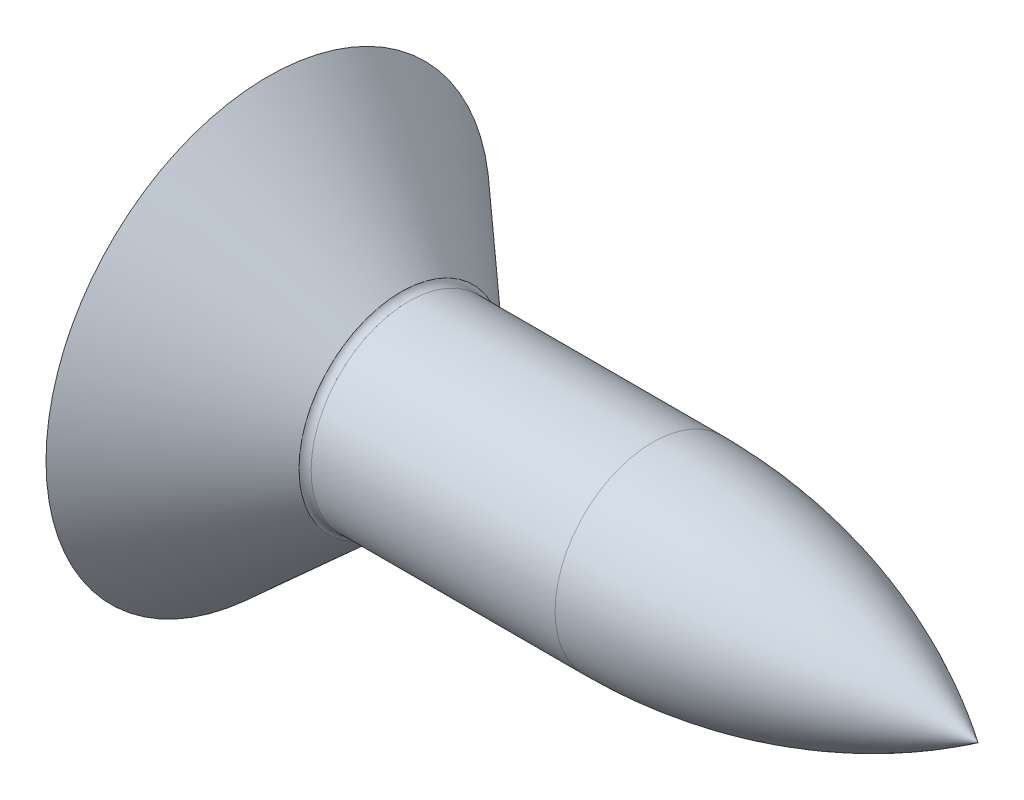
ISO-10303-21;
HEADER;
FILE_DESCRIPTION(('STEP AP214'),'2;1');
FILE_NAME('part.step','',(''),(''),'','','');
FILE_SCHEMA(('AUTOMOTIVE_DESIGN { 1 0 10303 214 1 1 1 1 }'));
ENDSEC;
DATA;
#1=APPLICATION_CONTEXT('core data for automotive mechanical design processes');
#2=APPLICATION_PROTOCOL_DEFINITION('international standard','automotive_design',2000,#1);
#3=PRODUCT_CONTEXT('',#1,'mechanical');
#4=PRODUCT('Part','Part','',(#3));
#5=PRODUCT_RELATED_PRODUCT_CATEGORY('part','',(#4));
#6=PRODUCT_DEFINITION_FORMATION('','',#4);
#7=PRODUCT_DEFINITION_CONTEXT('part definition',#1,'design');
#8=PRODUCT_DEFINITION('design','',#6,#7);
#9=PRODUCT_DEFINITION_SHAPE('','',#8);
#10=(LENGTH_UNIT() NAMED_UNIT(*) SI_UNIT(.MILLI.,.METRE.));
#11=(NAMED_UNIT(*) PLANE_ANGLE_UNIT() SI_UNIT($,.RADIAN.));
#12=(NAMED_UNIT(*) SI_UNIT($,.STERADIAN.) SOLID_ANGLE_UNIT());
#13=UNCERTAINTY_MEASURE_WITH_UNIT(LENGTH_MEASURE(1.E-05),#10,'distance_accuracy_value','');
#14=(GEOMETRIC_REPRESENTATION_CONTEXT(3) GLOBAL_UNCERTAINTY_ASSIGNED_CONTEXT((#13)) GLOBAL_UNIT_ASSIGNED_CONTEXT((#10,
#11,#12)) REPRESENTATION_CONTEXT('',''));
#15=CARTESIAN_POINT('',(0.,0.,0.));
#16=DIRECTION('',(0.,0.,1.));
#17=DIRECTION('',(1.,0.,0.));
#18=AXIS2_PLACEMENT_3D('',#15,#16,#17);
#19=CARTESIAN_POINT('',(0.,0.,0.));
#20=DIRECTION('',(-1.,0.,0.));
#21=DIRECTION('',(0.,0.,1.));
#22=AXIS2_PLACEMENT_3D('',#19,#20,#21);
#23=PLANE('',#22);
#24=CARTESIAN_POINT('',(0.,0.,0.));
#25=DIRECTION('',(-1.,0.,0.));
#26=DIRECTION('',(0.,0.,1.));
#27=AXIS2_PLACEMENT_3D('',#24,#25,#26);
#28=CIRCLE('',#27,2.5);
#29=CARTESIAN_POINT('',(0.,0.,2.5));
#30=VERTEX_POINT('',#29);
#31=EDGE_CURVE('E214',#30,#30,#28,.T.);
#32=ORIENTED_EDGE('',*,*,#31,.T.);
#33=EDGE_LOOP('',(#32));
#34=FACE_BOUND('',#33,.T.);
#35=DIRECTION('',(0.,0.,-1.));
#36=VECTOR('',#35,1.);
#37=CARTESIAN_POINT('',(0.,-0.370000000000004,1.3));
#38=LINE('',#37,#36);
#39=CARTESIAN_POINT('',(0.,-0.370000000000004,1.3));
#40=VERTEX_POINT('',#39);
#41=CARTESIAN_POINT('',(0.,-0.370000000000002,0.547609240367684));
#42=VERTEX_POINT('',#41);
#43=EDGE_CURVE('E468',#40,#42,#38,.T.);
#44=ORIENTED_EDGE('',*,*,#43,.T.);
#45=CARTESIAN_POINT('',(0.,0.,0.));
#46=DIRECTION('',(-1.,0.,0.));
#47=DIRECTION('',(0.,0.,1.));
#48=AXIS2_PLACEMENT_3D('',#45,#46,#47);
#49=CIRCLE('',#48,0.660890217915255);
#50=CARTESIAN_POINT('',(0.,-0.547609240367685,0.369999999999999));
#51=VERTEX_POINT('',#50);
#52=EDGE_CURVE('E343',#51,#42,#49,.T.);
#53=ORIENTED_EDGE('',*,*,#52,.F.);
#54=DIRECTION('',(0.,-1.,0.));
#55=VECTOR('',#54,1.);
#56=CARTESIAN_POINT('',(0.,1.3,0.37));
#57=LINE('',#56,#55);
#58=CARTESIAN_POINT('',(0.,-1.3,0.369999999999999));
#59=VERTEX_POINT('',#58);
#60=EDGE_CURVE('E416',#51,#59,#57,.T.);
#61=ORIENTED_EDGE('',*,*,#60,.T.);
#62=DIRECTION('',(0.,0.,1.));
#63=VECTOR('',#62,1.);
#64=CARTESIAN_POINT('',(0.,-1.3,-0.37));
#65=LINE('',#64,#63);
#66=CARTESIAN_POINT('',(0.,-1.3,-0.37));
#67=VERTEX_POINT('',#66);
#68=EDGE_CURVE('E219',#67,#59,#65,.T.);
#69=ORIENTED_EDGE('',*,*,#68,.F.);
#70=DIRECTION('',(0.,1.,0.));
#71=VECTOR('',#70,1.);
#72=CARTESIAN_POINT('',(0.,-1.3,-0.37));
#73=LINE('',#72,#71);
#74=CARTESIAN_POINT('',(0.,-0.547609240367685,-0.37));
#75=VERTEX_POINT('',#74);
#76=EDGE_CURVE('E49',#67,#75,#73,.T.);
#77=ORIENTED_EDGE('',*,*,#76,.T.);
#78=CARTESIAN_POINT('',(0.,-0.369999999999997,-0.547609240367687));
#79=VERTEX_POINT('',#78);
#80=EDGE_CURVE('E346',#79,#75,#49,.T.);
#81=ORIENTED_EDGE('',*,*,#80,.F.);
#82=CARTESIAN_POINT('',(0.,-0.369999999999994,-1.3));
#83=VERTEX_POINT('',#82);
#84=EDGE_CURVE('E467',#79,#83,#38,.T.);
#85=ORIENTED_EDGE('',*,*,#84,.T.);
#86=DIRECTION('',(0.,-1.,0.));
#87=VECTOR('',#86,1.);
#88=CARTESIAN_POINT('',(0.,0.370000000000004,-1.3));
#89=LINE('',#88,#87);
#90=CARTESIAN_POINT('',(0.,0.370000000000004,-1.3));
#91=VERTEX_POINT('',#90);
#92=EDGE_CURVE('E427',#91,#83,#89,.T.);
#93=ORIENTED_EDGE('',*,*,#92,.F.);
#94=DIRECTION('',(0.,0.,1.));
#95=VECTOR('',#94,1.);
#96=CARTESIAN_POINT('',(0.,0.370000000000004,-1.3));
#97=LINE('',#96,#95);
#98=CARTESIAN_POINT('',(0.,0.370000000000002,-0.547609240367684));
#99=VERTEX_POINT('',#98);
#100=EDGE_CURVE('E461',#91,#99,#97,.T.);
#101=ORIENTED_EDGE('',*,*,#100,.T.);
#102=CARTESIAN_POINT('',(0.,0.547609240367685,-0.37));
#103=VERTEX_POINT('',#102);
#104=EDGE_CURVE('E342',#103,#99,#49,.T.);
#105=ORIENTED_EDGE('',*,*,#104,.F.);
#106=CARTESIAN_POINT('',(0.,1.3,-0.37));
#107=VERTEX_POINT('',#106);
#108=EDGE_CURVE('E410',#103,#107,#73,.T.);
#109=ORIENTED_EDGE('',*,*,#108,.T.);
#110=DIRECTION('',(0.,0.,-1.));
#111=VECTOR('',#110,1.);
#112=CARTESIAN_POINT('',(0.,1.3,0.37));
#113=LINE('',#112,#111);
#114=CARTESIAN_POINT('',(0.,1.3,0.37));
#115=VERTEX_POINT('',#114);
#116=EDGE_CURVE('E417',#115,#107,#113,.T.);
#117=ORIENTED_EDGE('',*,*,#116,.F.);
#118=CARTESIAN_POINT('',(0.,0.547609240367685,0.37));
#119=VERTEX_POINT('',#118);
#120=EDGE_CURVE('E414',#115,#119,#57,.T.);
#121=ORIENTED_EDGE('',*,*,#120,.T.);
#122=CARTESIAN_POINT('',(0.,0.369999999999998,0.547609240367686));
#123=VERTEX_POINT('',#122);
#124=EDGE_CURVE('E338',#123,#119,#49,.T.);
#125=ORIENTED_EDGE('',*,*,#124,.F.);
#126=CARTESIAN_POINT('',(0.,0.369999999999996,1.3));
#127=VERTEX_POINT('',#126);
#128=EDGE_CURVE('E464',#123,#127,#97,.T.);
#129=ORIENTED_EDGE('',*,*,#128,.T.);
#130=DIRECTION('',(0.,1.,0.));
#131=VECTOR('',#130,1.);
#132=CARTESIAN_POINT('',(0.,-0.370000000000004,1.3));
#133=LINE('',#132,#131);
#134=EDGE_CURVE('E463',#40,#127,#133,.T.);
#135=ORIENTED_EDGE('',*,*,#134,.F.);
#136=EDGE_LOOP('',(#44,#53,#61,#69,#77,#81,#85,#93,#101,#105,#109,#117,#121,#125,#129,#135));
#137=FACE_BOUND('',#136,.T.);
#138=ADVANCED_FACE('F26',(#34,#137),#23,.T.);
#139=CARTESIAN_POINT('',(1.5,0.552127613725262,-0.37));
#140=DIRECTION('',(0.,0.,1.));
#141=DIRECTION('',(0.,-1.,0.));
#142=AXIS2_PLACEMENT_3D('',#139,#140,#141);
#143=PLANE('',#142);
#144=ORIENTED_EDGE('',*,*,#108,.F.);
#145=CARTESIAN_POINT('',(-1.01786528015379,0.631681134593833,-0.37));
#146=CARTESIAN_POINT('',(-0.81671122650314,0.615372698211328,-0.37));
#147=CARTESIAN_POINT('',(-0.615568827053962,0.598917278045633,-0.37));
#148=CARTESIAN_POINT('',(-0.213313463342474,0.565594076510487,-0.37));
#149=CARTESIAN_POINT('',(-0.0122004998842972,0.548726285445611,-0.37));
#150=CARTESIAN_POINT('',(0.38998037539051,0.514460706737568,-0.37));
#151=CARTESIAN_POINT('',(0.591048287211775,0.497062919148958,-0.37));
#152=CARTESIAN_POINT('',(0.993117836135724,0.461546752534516,-0.37));
#153=CARTESIAN_POINT('',(1.19411947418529,0.443428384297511,-0.37));
#154=CARTESIAN_POINT('',(1.51280354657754,0.413874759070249,-0.37));
#155=CARTESIAN_POINT('',(1.63051742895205,0.402779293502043,-0.37));
#156=CARTESIAN_POINT('',(1.86590055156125,0.380130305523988,-0.37));
#157=CARTESIAN_POINT('',(1.98356979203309,0.368576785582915,-0.37));
#158=CARTESIAN_POINT('',(2.21885433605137,0.344876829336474,-0.37));
#159=CARTESIAN_POINT('',(2.33646963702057,0.332730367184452,-0.37));
#160=CARTESIAN_POINT('',(2.57161134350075,0.30758754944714,-0.37));
#161=CARTESIAN_POINT('',(2.68913774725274,0.294591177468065,-0.37));
#162=CARTESIAN_POINT('',(2.80660252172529,0.281041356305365,-0.37));
#163=B_SPLINE_CURVE_WITH_KNOTS('',3,(#145,#146,#147,#148,#149,#150,#151,#152,#153,#154,#155,
#156,#157,#158,#159,#160,#161,#162),.UNSPECIFIED.,.F.,.F.,(4,2,2,2,2,2,2,2,4),(0.,
0.605442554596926,1.21089935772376,1.81635609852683,2.42180377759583,2.77650999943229,
3.13121430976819,3.48593409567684,3.84066072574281),.UNSPECIFIED.);
#164=CARTESIAN_POINT('',(1.5,0.415013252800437,-0.370000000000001));
#165=VERTEX_POINT('',#164);
#166=EDGE_CURVE('E251',#103,#165,#163,.T.);
#167=ORIENTED_EDGE('',*,*,#166,.T.);
#168=DIRECTION('',(0.,1.,0.));
#169=VECTOR('',#168,1.);
#170=CARTESIAN_POINT('',(1.5,-0.552127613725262,-0.37));
#171=LINE('',#170,#169);
#172=CARTESIAN_POINT('',(1.5,0.552127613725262,-0.37));
#173=VERTEX_POINT('',#172);
#174=EDGE_CURVE('E400',#165,#173,#171,.T.);
#175=ORIENTED_EDGE('',*,*,#174,.T.);
#176=DIRECTION('',(0.89493436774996,-0.446197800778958,0.));
#177=VECTOR('',#176,1.);
#178=CARTESIAN_POINT('',(0.,1.3,-0.37));
#179=LINE('',#178,#177);
#180=EDGE_CURVE('E408',#107,#173,#179,.T.);
#181=ORIENTED_EDGE('',*,*,#180,.F.);
#182=EDGE_LOOP('',(#144,#167,#175,#181));
#183=FACE_BOUND('',#182,.T.);
#184=ADVANCED_FACE('F183',(#183),#143,.T.);
#185=CARTESIAN_POINT('',(1.5,-0.552127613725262,-0.37));
#186=VERTEX_POINT('',#185);
#187=CARTESIAN_POINT('',(1.5,-0.415013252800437,-0.370000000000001));
#188=VERTEX_POINT('',#187);
#189=EDGE_CURVE('E395',#186,#188,#171,.T.);
#190=ORIENTED_EDGE('',*,*,#189,.T.);
#191=CARTESIAN_POINT('',(-1.01786528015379,-0.631681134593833,-0.37));
#192=CARTESIAN_POINT('',(-0.81671122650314,-0.615372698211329,-0.37));
#193=CARTESIAN_POINT('',(-0.615568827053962,-0.598917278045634,-0.37));
#194=CARTESIAN_POINT('',(-0.213313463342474,-0.565594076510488,-0.37));
#195=CARTESIAN_POINT('',(-0.012200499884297,-0.548726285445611,-0.37));
#196=CARTESIAN_POINT('',(0.38998037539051,-0.514460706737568,-0.37));
#197=CARTESIAN_POINT('',(0.591048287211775,-0.497062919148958,-0.37));
#198=CARTESIAN_POINT('',(0.993117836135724,-0.461546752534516,-0.37));
#199=CARTESIAN_POINT('',(1.19411947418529,-0.443428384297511,-0.37));
#200=CARTESIAN_POINT('',(1.51280354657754,-0.413874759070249,-0.37));
#201=CARTESIAN_POINT('',(1.63051742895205,-0.402779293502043,-0.37));
#202=CARTESIAN_POINT('',(1.86590055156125,-0.380130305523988,-0.37));
#203=CARTESIAN_POINT('',(1.9835697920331,-0.368576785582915,-0.37));
#204=CARTESIAN_POINT('',(2.21885433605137,-0.344876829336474,-0.37));
#205=CARTESIAN_POINT('',(2.33646963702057,-0.332730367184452,-0.37));
#206=CARTESIAN_POINT('',(2.57161134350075,-0.30758754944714,-0.37));
#207=CARTESIAN_POINT('',(2.68913774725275,-0.294591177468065,-0.37));
#208=CARTESIAN_POINT('',(2.80660252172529,-0.281041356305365,-0.37));
#209=B_SPLINE_CURVE_WITH_KNOTS('',3,(#191,#192,#193,#194,#195,#196,#197,#198,#199,#200,#201,
#202,#203,#204,#205,#206,#207,#208),.UNSPECIFIED.,.F.,.F.,(4,2,2,2,2,2,2,2,4),(0.,
0.605442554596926,1.21089935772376,1.81635609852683,2.42180377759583,2.77650999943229,
3.13121430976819,3.48593409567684,3.84066072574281),.UNSPECIFIED.);
#210=EDGE_CURVE('E245',#188,#75,#209,.F.);
#211=ORIENTED_EDGE('',*,*,#210,.T.);
#212=ORIENTED_EDGE('',*,*,#76,.F.);
#213=DIRECTION('',(0.89493436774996,0.446197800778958,0.));
#214=VECTOR('',#213,1.);
#215=CARTESIAN_POINT('',(0.,-1.3,-0.37));
#216=LINE('',#215,#214);
#217=EDGE_CURVE('E404',#67,#186,#216,.T.);
#218=ORIENTED_EDGE('',*,*,#217,.T.);
#219=EDGE_LOOP('',(#190,#211,#212,#218));
#220=FACE_BOUND('',#219,.T.);
#221=ADVANCED_FACE('F190',(#220),#143,.T.);
#222=CARTESIAN_POINT('',(1.5,-0.552127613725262,0.369999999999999));
#223=DIRECTION('',(0.,0.,-1.));
#224=DIRECTION('',(0.,1.,0.));
#225=AXIS2_PLACEMENT_3D('',#222,#223,#224);
#226=PLANE('',#225);
#227=DIRECTION('',(0.,-1.,0.));
#228=VECTOR('',#227,1.);
#229=CARTESIAN_POINT('',(1.5,0.552127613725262,0.37));
#230=LINE('',#229,#228);
#231=CARTESIAN_POINT('',(1.5,0.552127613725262,0.37));
#232=VERTEX_POINT('',#231);
#233=CARTESIAN_POINT('',(1.5,0.415013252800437,0.370000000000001));
#234=VERTEX_POINT('',#233);
#235=EDGE_CURVE('E390',#232,#234,#230,.T.);
#236=ORIENTED_EDGE('',*,*,#235,.T.);
#237=CARTESIAN_POINT('',(-1.01786528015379,0.631681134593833,0.37));
#238=CARTESIAN_POINT('',(-0.81671122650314,0.615372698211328,0.37));
#239=CARTESIAN_POINT('',(-0.615568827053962,0.598917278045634,0.37));
#240=CARTESIAN_POINT('',(-0.213313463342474,0.565594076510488,0.37));
#241=CARTESIAN_POINT('',(-0.0122004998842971,0.548726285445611,0.37));
#242=CARTESIAN_POINT('',(0.38998037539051,0.514460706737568,0.37));
#243=CARTESIAN_POINT('',(0.591048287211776,0.497062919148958,0.37));
#244=CARTESIAN_POINT('',(0.993117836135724,0.461546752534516,0.37));
#245=CARTESIAN_POINT('',(1.19411947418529,0.443428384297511,0.37));
#246=CARTESIAN_POINT('',(1.51280354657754,0.413874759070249,0.37));
#247=CARTESIAN_POINT('',(1.63051742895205,0.402779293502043,0.37));
#248=CARTESIAN_POINT('',(1.86590055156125,0.380130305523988,0.37));
#249=CARTESIAN_POINT('',(1.9835697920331,0.368576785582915,0.37));
#250=CARTESIAN_POINT('',(2.21885433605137,0.344876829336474,0.37));
#251=CARTESIAN_POINT('',(2.33646963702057,0.332730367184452,0.37));
#252=CARTESIAN_POINT('',(2.57161134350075,0.307587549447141,0.37));
#253=CARTESIAN_POINT('',(2.68913774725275,0.294591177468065,0.37));
#254=CARTESIAN_POINT('',(2.80660252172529,0.281041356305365,0.37));
#255=B_SPLINE_CURVE_WITH_KNOTS('',3,(#237,#238,#239,#240,#241,#242,#243,#244,#245,#246,#247,
#248,#249,#250,#251,#252,#253,#254),.UNSPECIFIED.,.F.,.F.,(4,2,2,2,2,2,2,2,4),(0.,
0.605442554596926,1.21089935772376,1.81635609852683,2.42180377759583,2.77650999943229,
3.13121430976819,3.48593409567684,3.84066072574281),.UNSPECIFIED.);
#256=EDGE_CURVE('E300',#234,#119,#255,.F.);
#257=ORIENTED_EDGE('',*,*,#256,.T.);
#258=ORIENTED_EDGE('',*,*,#120,.F.);
#259=DIRECTION('',(0.89493436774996,-0.446197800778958,0.));
#260=VECTOR('',#259,1.);
#261=CARTESIAN_POINT('',(0.,1.3,0.37));
#262=LINE('',#261,#260);
#263=EDGE_CURVE('E407',#115,#232,#262,.T.);
#264=ORIENTED_EDGE('',*,*,#263,.T.);
#265=EDGE_LOOP('',(#236,#257,#258,#264));
#266=FACE_BOUND('',#265,.T.);
#267=ADVANCED_FACE('F240',(#266),#226,.T.);
#268=ORIENTED_EDGE('',*,*,#60,.F.);
#269=CARTESIAN_POINT('',(-1.01786528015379,-0.631681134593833,0.369999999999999));
#270=CARTESIAN_POINT('',(-0.81671122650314,-0.615372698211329,0.369999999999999));
#271=CARTESIAN_POINT('',(-0.615568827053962,-0.598917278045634,0.369999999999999));
#272=CARTESIAN_POINT('',(-0.213313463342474,-0.565594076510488,0.369999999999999));
#273=CARTESIAN_POINT('',(-0.0122004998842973,-0.548726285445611,0.369999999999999));
#274=CARTESIAN_POINT('',(0.38998037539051,-0.514460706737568,0.369999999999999));
#275=CARTESIAN_POINT('',(0.591048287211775,-0.497062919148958,0.369999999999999));
#276=CARTESIAN_POINT('',(0.993117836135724,-0.461546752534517,0.369999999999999));
#277=CARTESIAN_POINT('',(1.19411947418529,-0.443428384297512,0.369999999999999));
#278=CARTESIAN_POINT('',(1.51280354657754,-0.41387475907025,0.369999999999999));
#279=CARTESIAN_POINT('',(1.63051742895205,-0.402779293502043,0.37));
#280=CARTESIAN_POINT('',(1.86590055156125,-0.380130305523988,0.37));
#281=CARTESIAN_POINT('',(1.98356979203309,-0.368576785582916,0.37));
#282=CARTESIAN_POINT('',(2.21885433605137,-0.344876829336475,0.37));
#283=CARTESIAN_POINT('',(2.33646963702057,-0.332730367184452,0.37));
#284=CARTESIAN_POINT('',(2.57161134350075,-0.307587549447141,0.37));
#285=CARTESIAN_POINT('',(2.68913774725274,-0.294591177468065,0.37));
#286=CARTESIAN_POINT('',(2.80660252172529,-0.281041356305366,0.37));
#287=B_SPLINE_CURVE_WITH_KNOTS('',3,(#269,#270,#271,#272,#273,#274,#275,#276,#277,#278,#279,
#280,#281,#282,#283,#284,#285,#286),.UNSPECIFIED.,.F.,.F.,(4,2,2,2,2,2,2,2,4),(0.,
0.605442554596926,1.21089935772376,1.81635609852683,2.42180377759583,2.77650999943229,
3.13121430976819,3.48593409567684,3.84066072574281),.UNSPECIFIED.);
#288=CARTESIAN_POINT('',(1.5,-0.415013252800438,0.37));
#289=VERTEX_POINT('',#288);
#290=EDGE_CURVE('E295',#51,#289,#287,.T.);
#291=ORIENTED_EDGE('',*,*,#290,.T.);
#292=CARTESIAN_POINT('',(1.5,-0.552127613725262,0.369999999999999));
#293=VERTEX_POINT('',#292);
#294=EDGE_CURVE('E392',#289,#293,#230,.T.);
#295=ORIENTED_EDGE('',*,*,#294,.T.);
#296=DIRECTION('',(0.89493436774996,0.446197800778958,0.));
#297=VECTOR('',#296,1.);
#298=CARTESIAN_POINT('',(0.,-1.3,0.369999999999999));
#299=LINE('',#298,#297);
#300=EDGE_CURVE('E401',#59,#293,#299,.T.);
#301=ORIENTED_EDGE('',*,*,#300,.F.);
#302=EDGE_LOOP('',(#268,#291,#295,#301));
#303=FACE_BOUND('',#302,.T.);
#304=ADVANCED_FACE('F442',(#303),#226,.T.);
#305=CARTESIAN_POINT('',(1.5,0.552127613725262,-0.37));
#306=DIRECTION('',(-1.,0.,0.));
#307=DIRECTION('',(0.,0.,1.));
#308=AXIS2_PLACEMENT_3D('',#305,#306,#307);
#309=PLANE('',#308);
#310=DIRECTION('',(0.,1.,0.));
#311=VECTOR('',#310,1.);
#312=CARTESIAN_POINT('',(1.5,-0.370000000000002,0.55212761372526));
#313=LINE('',#312,#311);
#314=CARTESIAN_POINT('',(1.5,-0.370000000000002,0.55212761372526));
#315=VERTEX_POINT('',#314);
#316=CARTESIAN_POINT('',(1.5,-0.0655064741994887,0.552127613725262));
#317=VERTEX_POINT('',#316);
#318=EDGE_CURVE('E487',#315,#317,#313,.T.);
#319=ORIENTED_EDGE('',*,*,#318,.T.);
#320=CARTESIAN_POINT('',(1.5,0.,0.));
#321=DIRECTION('',(-1.,0.,0.));
#322=DIRECTION('',(0.,0.,1.));
#323=AXIS2_PLACEMENT_3D('',#320,#321,#322);
#324=CIRCLE('',#323,0.556);
#325=CARTESIAN_POINT('',(1.5,-0.370000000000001,0.415013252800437));
#326=VERTEX_POINT('',#325);
#327=EDGE_CURVE('E355',#326,#317,#324,.T.);
#328=ORIENTED_EDGE('',*,*,#327,.F.);
#329=DIRECTION('',(0.,0.,-1.));
#330=VECTOR('',#329,1.);
#331=CARTESIAN_POINT('',(1.5,-0.370000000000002,0.55212761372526));
#332=LINE('',#331,#330);
#333=EDGE_CURVE('E490',#315,#326,#332,.T.);
#334=ORIENTED_EDGE('',*,*,#333,.F.);
#335=EDGE_LOOP('',(#319,#328,#334));
#336=FACE_BOUND('',#335,.T.);
#337=ADVANCED_FACE('F438',(#336),#309,.T.);
#338=ORIENTED_EDGE('',*,*,#294,.F.);
#339=CARTESIAN_POINT('',(1.5,-0.552127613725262,0.0655064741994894));
#340=VERTEX_POINT('',#339);
#341=EDGE_CURVE('E360',#340,#289,#324,.T.);
#342=ORIENTED_EDGE('',*,*,#341,.F.);
#343=DIRECTION('',(0.,0.,1.));
#344=VECTOR('',#343,1.);
#345=CARTESIAN_POINT('',(1.5,-0.552127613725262,-0.37));
#346=LINE('',#345,#344);
#347=EDGE_CURVE('E456',#340,#293,#346,.T.);
#348=ORIENTED_EDGE('',*,*,#347,.T.);
#349=EDGE_LOOP('',(#338,#342,#348));
#350=FACE_BOUND('',#349,.T.);
#351=ADVANCED_FACE('F441',(#350),#309,.T.);
#352=CARTESIAN_POINT('',(1.5,-0.552127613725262,-0.0655064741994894));
#353=VERTEX_POINT('',#352);
#354=EDGE_CURVE('E405',#186,#353,#346,.T.);
#355=ORIENTED_EDGE('',*,*,#354,.T.);
#356=EDGE_CURVE('E364',#188,#353,#324,.T.);
#357=ORIENTED_EDGE('',*,*,#356,.F.);
#358=ORIENTED_EDGE('',*,*,#189,.F.);
#359=EDGE_LOOP('',(#355,#357,#358));
#360=FACE_BOUND('',#359,.T.);
#361=ADVANCED_FACE('F459',(#360),#309,.T.);
#362=CARTESIAN_POINT('',(1.5,-0.369999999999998,-0.415013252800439));
#363=VERTEX_POINT('',#362);
#364=CARTESIAN_POINT('',(1.5,-0.369999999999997,-0.552127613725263));
#365=VERTEX_POINT('',#364);
#366=EDGE_CURVE('E489',#363,#365,#332,.T.);
#367=ORIENTED_EDGE('',*,*,#366,.F.);
#368=CARTESIAN_POINT('',(1.5,-0.0655064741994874,-0.552127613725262));
#369=VERTEX_POINT('',#368);
#370=EDGE_CURVE('E369',#369,#363,#324,.T.);
#371=ORIENTED_EDGE('',*,*,#370,.F.);
#372=DIRECTION('',(0.,-1.,0.));
#373=VECTOR('',#372,1.);
#374=CARTESIAN_POINT('',(1.5,0.370000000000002,-0.55212761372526));
#375=LINE('',#374,#373);
#376=EDGE_CURVE('E491',#369,#365,#375,.T.);
#377=ORIENTED_EDGE('',*,*,#376,.T.);
#378=EDGE_LOOP('',(#367,#371,#377));
#379=FACE_BOUND('',#378,.T.);
#380=ADVANCED_FACE('F436',(#379),#309,.T.);
#381=CARTESIAN_POINT('',(1.5,0.370000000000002,-0.55212761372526));
#382=VERTEX_POINT('',#381);
#383=CARTESIAN_POINT('',(1.5,0.0655064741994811,-0.552127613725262));
#384=VERTEX_POINT('',#383);
#385=EDGE_CURVE('E258',#382,#384,#375,.T.);
#386=ORIENTED_EDGE('',*,*,#385,.T.);
#387=CARTESIAN_POINT('',(1.5,0.370000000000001,-0.415013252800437));
#388=VERTEX_POINT('',#387);
#389=EDGE_CURVE('E41',#388,#384,#324,.T.);
#390=ORIENTED_EDGE('',*,*,#389,.F.);
#391=DIRECTION('',(0.,0.,1.));
#392=VECTOR('',#391,1.);
#393=CARTESIAN_POINT('',(1.5,0.370000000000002,-0.55212761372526));
#394=LINE('',#393,#392);
#395=EDGE_CURVE('E484',#382,#388,#394,.T.);
#396=ORIENTED_EDGE('',*,*,#395,.F.);
#397=EDGE_LOOP('',(#386,#390,#396));
#398=FACE_BOUND('',#397,.T.);
#399=ADVANCED_FACE('F430',(#398),#309,.T.);
#400=ORIENTED_EDGE('',*,*,#174,.F.);
#401=CARTESIAN_POINT('',(1.5,0.552127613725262,-0.0655064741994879));
#402=VERTEX_POINT('',#401);
#403=EDGE_CURVE('E374',#402,#165,#324,.T.);
#404=ORIENTED_EDGE('',*,*,#403,.F.);
#405=DIRECTION('',(0.,0.,-1.));
#406=VECTOR('',#405,1.);
#407=CARTESIAN_POINT('',(1.5,0.552127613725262,0.37));
#408=LINE('',#407,#406);
#409=EDGE_CURVE('E388',#402,#173,#408,.T.);
#410=ORIENTED_EDGE('',*,*,#409,.T.);
#411=EDGE_LOOP('',(#400,#404,#410));
#412=FACE_BOUND('',#411,.T.);
#413=ADVANCED_FACE('F428',(#412),#309,.T.);
#414=CARTESIAN_POINT('',(1.5,0.552127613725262,0.0655064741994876));
#415=VERTEX_POINT('',#414);
#416=EDGE_CURVE('E385',#232,#415,#408,.T.);
#417=ORIENTED_EDGE('',*,*,#416,.T.);
#418=EDGE_CURVE('E354',#234,#415,#324,.T.);
#419=ORIENTED_EDGE('',*,*,#418,.F.);
#420=ORIENTED_EDGE('',*,*,#235,.F.);
#421=EDGE_LOOP('',(#417,#419,#420));
#422=FACE_BOUND('',#421,.T.);
#423=ADVANCED_FACE('F389',(#422),#309,.T.);
#424=CARTESIAN_POINT('',(1.5,0.369999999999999,0.415013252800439));
#425=VERTEX_POINT('',#424);
#426=CARTESIAN_POINT('',(1.5,0.369999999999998,0.552127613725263));
#427=VERTEX_POINT('',#426);
#428=EDGE_CURVE('E257',#425,#427,#394,.T.);
#429=ORIENTED_EDGE('',*,*,#428,.F.);
#430=CARTESIAN_POINT('',(1.5,0.0655064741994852,0.552127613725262));
#431=VERTEX_POINT('',#430);
#432=EDGE_CURVE('E348',#431,#425,#324,.T.);
#433=ORIENTED_EDGE('',*,*,#432,.F.);
#434=EDGE_CURVE('E486',#431,#427,#313,.T.);
#435=ORIENTED_EDGE('',*,*,#434,.T.);
#436=EDGE_LOOP('',(#429,#433,#435));
#437=FACE_BOUND('',#436,.T.);
#438=ADVANCED_FACE('F236',(#437),#309,.T.);
#439=CARTESIAN_POINT('',(1.5,0.552127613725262,0.37));
#440=DIRECTION('',(0.446197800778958,0.89493436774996,0.));
#441=DIRECTION('',(-0.89493436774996,0.446197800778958,0.));
#442=AXIS2_PLACEMENT_3D('',#439,#440,#441);
#443=PLANE('',#442);
#444=CARTESIAN_POINT('',(2.47007520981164,0.0684659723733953,0.));
#445=DIRECTION('',(0.446197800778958,0.89493436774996,0.));
#446=DIRECTION('',(-0.89493436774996,0.446197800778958,0.));
#447=AXIS2_PLACEMENT_3D('',#444,#445,#446);
#448=ELLIPSE('',#447,1.09405678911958,0.483340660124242);
#449=EDGE_CURVE('E309',#415,#402,#448,.F.);
#450=ORIENTED_EDGE('',*,*,#449,.F.);
#451=ORIENTED_EDGE('',*,*,#416,.F.);
#452=ORIENTED_EDGE('',*,*,#263,.F.);
#453=ORIENTED_EDGE('',*,*,#116,.T.);
#454=ORIENTED_EDGE('',*,*,#180,.T.);
#455=ORIENTED_EDGE('',*,*,#409,.F.);
#456=EDGE_LOOP('',(#450,#451,#452,#453,#454,#455));
#457=FACE_BOUND('',#456,.T.);
#458=ADVANCED_FACE('F233',(#457),#443,.F.);
#459=CARTESIAN_POINT('',(0.,-1.3,-0.37));
#460=DIRECTION('',(0.446197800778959,-0.89493436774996,0.));
#461=DIRECTION('',(0.89493436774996,0.446197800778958,0.));
#462=AXIS2_PLACEMENT_3D('',#459,#460,#461);
#463=PLANE('',#462);
#464=CARTESIAN_POINT('',(2.47007520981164,-0.0684659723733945,0.));
#465=DIRECTION('',(0.446197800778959,-0.89493436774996,0.));
#466=DIRECTION('',(-0.89493436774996,-0.446197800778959,0.));
#467=AXIS2_PLACEMENT_3D('',#464,#465,#466);
#468=ELLIPSE('',#467,1.09405678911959,0.483340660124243);
#469=EDGE_CURVE('E313',#353,#340,#468,.F.);
#470=ORIENTED_EDGE('',*,*,#469,.F.);
#471=ORIENTED_EDGE('',*,*,#354,.F.);
#472=ORIENTED_EDGE('',*,*,#217,.F.);
#473=ORIENTED_EDGE('',*,*,#68,.T.);
#474=ORIENTED_EDGE('',*,*,#300,.T.);
#475=ORIENTED_EDGE('',*,*,#347,.F.);
#476=EDGE_LOOP('',(#470,#471,#472,#473,#474,#475));
#477=FACE_BOUND('',#476,.T.);
#478=ADVANCED_FACE('F235',(#477),#463,.F.);
#479=CARTESIAN_POINT('',(1.5,0.369999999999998,0.552127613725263));
#480=DIRECTION('',(0.,-1.,0.));
#481=DIRECTION('',(0.,0.,-1.));
#482=AXIS2_PLACEMENT_3D('',#479,#480,#481);
#483=PLANE('',#482);
#484=ORIENTED_EDGE('',*,*,#128,.F.);
#485=CARTESIAN_POINT('',(-1.01786528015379,0.369999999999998,0.631681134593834));
#486=CARTESIAN_POINT('',(-0.81671122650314,0.369999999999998,0.61537269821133));
#487=CARTESIAN_POINT('',(-0.615568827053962,0.369999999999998,0.598917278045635));
#488=CARTESIAN_POINT('',(-0.213313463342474,0.369999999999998,0.565594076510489));
#489=CARTESIAN_POINT('',(-0.0122004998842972,0.369999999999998,0.548726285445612));
#490=CARTESIAN_POINT('',(0.38998037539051,0.369999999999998,0.514460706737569));
#491=CARTESIAN_POINT('',(0.591048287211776,0.369999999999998,0.497062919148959));
#492=CARTESIAN_POINT('',(0.993117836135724,0.369999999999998,0.461546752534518));
#493=CARTESIAN_POINT('',(1.19411947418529,0.369999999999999,0.443428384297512));
#494=CARTESIAN_POINT('',(1.51280354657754,0.369999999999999,0.41387475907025));
#495=CARTESIAN_POINT('',(1.63051742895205,0.369999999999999,0.402779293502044));
#496=CARTESIAN_POINT('',(1.86590055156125,0.369999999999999,0.380130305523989));
#497=CARTESIAN_POINT('',(1.9835697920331,0.369999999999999,0.368576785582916));
#498=CARTESIAN_POINT('',(2.21885433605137,0.369999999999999,0.344876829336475));
#499=CARTESIAN_POINT('',(2.33646963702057,0.369999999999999,0.332730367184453));
#500=CARTESIAN_POINT('',(2.57161134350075,0.369999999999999,0.307587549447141));
#501=CARTESIAN_POINT('',(2.68913774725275,0.369999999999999,0.294591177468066));
#502=CARTESIAN_POINT('',(2.80660252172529,0.369999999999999,0.281041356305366));
#503=B_SPLINE_CURVE_WITH_KNOTS('',3,(#485,#486,#487,#488,#489,#490,#491,#492,#493,#494,#495,
#496,#497,#498,#499,#500,#501,#502),.UNSPECIFIED.,.F.,.F.,(4,2,2,2,2,2,2,2,4),(0.,
0.605442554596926,1.21089935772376,1.81635609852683,2.42180377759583,2.77650999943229,
3.13121430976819,3.48593409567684,3.84066072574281),.UNSPECIFIED.);
#504=EDGE_CURVE('E288',#123,#425,#503,.T.);
#505=ORIENTED_EDGE('',*,*,#504,.T.);
#506=ORIENTED_EDGE('',*,*,#428,.T.);
#507=DIRECTION('',(0.89493436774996,0.,-0.446197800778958));
#508=VECTOR('',#507,1.);
#509=CARTESIAN_POINT('',(0.,0.369999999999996,1.3));
#510=LINE('',#509,#508);
#511=EDGE_CURVE('E475',#127,#427,#510,.T.);
#512=ORIENTED_EDGE('',*,*,#511,.F.);
#513=EDGE_LOOP('',(#484,#505,#506,#512));
#514=FACE_BOUND('',#513,.T.);
#515=ADVANCED_FACE('F446',(#514),#483,.T.);
#516=CARTESIAN_POINT('',(1.5,-0.369999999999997,-0.552127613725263));
#517=DIRECTION('',(0.,1.,0.));
#518=DIRECTION('',(0.,0.,1.));
#519=AXIS2_PLACEMENT_3D('',#516,#517,#518);
#520=PLANE('',#519);
#521=ORIENTED_EDGE('',*,*,#333,.T.);
#522=CARTESIAN_POINT('',(-1.01786528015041,-0.370000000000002,0.631681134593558));
#523=CARTESIAN_POINT('',(-0.816711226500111,-0.370000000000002,0.61537269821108));
#524=CARTESIAN_POINT('',(-0.615568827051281,-0.370000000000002,0.598917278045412));
#525=CARTESIAN_POINT('',(-0.213313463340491,-0.370000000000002,0.56559407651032));
#526=CARTESIAN_POINT('',(-0.012200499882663,-0.370000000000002,0.548726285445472));
#527=CARTESIAN_POINT('',(0.389980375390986,-0.370000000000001,0.514460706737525));
#528=CARTESIAN_POINT('',(0.591048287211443,-0.370000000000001,0.497062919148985));
#529=CARTESIAN_POINT('',(0.993117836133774,-0.370000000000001,0.461546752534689));
#530=CARTESIAN_POINT('',(1.19411947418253,-0.370000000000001,0.44342838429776));
#531=CARTESIAN_POINT('',(1.51280354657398,-0.370000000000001,0.413874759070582));
#532=CARTESIAN_POINT('',(1.63051742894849,-0.370000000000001,0.40277929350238));
#533=CARTESIAN_POINT('',(1.86590055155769,-0.370000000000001,0.380130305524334));
#534=CARTESIAN_POINT('',(1.98356979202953,-0.370000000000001,0.368576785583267));
#535=CARTESIAN_POINT('',(2.21885433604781,-0.370000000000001,0.344876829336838));
#536=CARTESIAN_POINT('',(2.33646963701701,-0.370000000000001,0.332730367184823));
#537=CARTESIAN_POINT('',(2.57161134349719,-0.370000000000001,0.307587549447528));
#538=CARTESIAN_POINT('',(2.68913774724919,-0.370000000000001,0.294591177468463));
#539=CARTESIAN_POINT('',(2.80660252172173,-0.370000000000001,0.281041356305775));
#540=B_SPLINE_CURVE_WITH_KNOTS('',3,(#522,#523,#524,#525,#526,#527,#528,#529,#530,#531,#532,
#533,#534,#535,#536,#537,#538,#539),.UNSPECIFIED.,.F.,.F.,(4,2,2,2,2,2,2,2,4),(0.,
0.605442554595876,1.21089935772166,1.8163560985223,2.42180377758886,2.77650999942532,
3.13121430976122,3.48593409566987,3.84066072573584),.UNSPECIFIED.);
#541=EDGE_CURVE('E282',#326,#42,#540,.F.);
#542=ORIENTED_EDGE('',*,*,#541,.T.);
#543=ORIENTED_EDGE('',*,*,#43,.F.);
#544=DIRECTION('',(0.89493436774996,0.,-0.446197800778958));
#545=VECTOR('',#544,1.);
#546=CARTESIAN_POINT('',(0.,-0.370000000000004,1.3));
#547=LINE('',#546,#545);
#548=EDGE_CURVE('E472',#40,#315,#547,.T.);
#549=ORIENTED_EDGE('',*,*,#548,.T.);
#550=EDGE_LOOP('',(#521,#542,#543,#549));
#551=FACE_BOUND('',#550,.T.);
#552=ADVANCED_FACE('F451',(#551),#520,.T.);
#553=CARTESIAN_POINT('',(1.5,-0.370000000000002,0.55212761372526));
#554=DIRECTION('',(0.446197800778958,0.,0.89493436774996));
#555=DIRECTION('',(-0.89493436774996,0.,0.446197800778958));
#556=AXIS2_PLACEMENT_3D('',#553,#554,#555);
#557=PLANE('',#556);
#558=CARTESIAN_POINT('',(2.47007520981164,0.,0.0684659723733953));
#559=DIRECTION('',(0.446197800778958,0.,0.89493436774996));
#560=DIRECTION('',(-0.89493436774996,0.,0.446197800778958));
#561=AXIS2_PLACEMENT_3D('',#558,#559,#560);
#562=ELLIPSE('',#561,1.09405678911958,0.483340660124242);
#563=EDGE_CURVE('E325',#317,#431,#562,.F.);
#564=ORIENTED_EDGE('',*,*,#563,.F.);
#565=ORIENTED_EDGE('',*,*,#318,.F.);
#566=ORIENTED_EDGE('',*,*,#548,.F.);
#567=ORIENTED_EDGE('',*,*,#134,.T.);
#568=ORIENTED_EDGE('',*,*,#511,.T.);
#569=ORIENTED_EDGE('',*,*,#434,.F.);
#570=EDGE_LOOP('',(#564,#565,#566,#567,#568,#569));
#571=FACE_BOUND('',#570,.T.);
#572=ADVANCED_FACE('F444',(#571),#557,.F.);
#573=ORIENTED_EDGE('',*,*,#395,.T.);
#574=CARTESIAN_POINT('',(-1.01786528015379,0.370000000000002,-0.631681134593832));
#575=CARTESIAN_POINT('',(-0.81671122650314,0.370000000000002,-0.615372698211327));
#576=CARTESIAN_POINT('',(-0.615568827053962,0.370000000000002,-0.598917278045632));
#577=CARTESIAN_POINT('',(-0.213313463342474,0.370000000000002,-0.565594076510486));
#578=CARTESIAN_POINT('',(-0.0122004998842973,0.370000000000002,-0.54872628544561));
#579=CARTESIAN_POINT('',(0.38998037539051,0.370000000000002,-0.514460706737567));
#580=CARTESIAN_POINT('',(0.591048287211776,0.370000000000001,-0.497062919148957));
#581=CARTESIAN_POINT('',(0.993117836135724,0.370000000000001,-0.461546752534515));
#582=CARTESIAN_POINT('',(1.19411947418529,0.370000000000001,-0.44342838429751));
#583=CARTESIAN_POINT('',(1.51280354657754,0.370000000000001,-0.413874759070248));
#584=CARTESIAN_POINT('',(1.63051742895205,0.370000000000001,-0.402779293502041));
#585=CARTESIAN_POINT('',(1.86590055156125,0.370000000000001,-0.380130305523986));
#586=CARTESIAN_POINT('',(1.98356979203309,0.370000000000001,-0.368576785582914));
#587=CARTESIAN_POINT('',(2.21885433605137,0.370000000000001,-0.344876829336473));
#588=CARTESIAN_POINT('',(2.33646963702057,0.370000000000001,-0.332730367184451));
#589=CARTESIAN_POINT('',(2.57161134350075,0.370000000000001,-0.307587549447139));
#590=CARTESIAN_POINT('',(2.68913774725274,0.370000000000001,-0.294591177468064));
#591=CARTESIAN_POINT('',(2.80660252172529,0.370000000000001,-0.281041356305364));
#592=B_SPLINE_CURVE_WITH_KNOTS('',3,(#574,#575,#576,#577,#578,#579,#580,#581,#582,#583,#584,
#585,#586,#587,#588,#589,#590,#591),.UNSPECIFIED.,.F.,.F.,(4,2,2,2,2,2,2,2,4),(0.,
0.605442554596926,1.21089935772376,1.81635609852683,2.42180377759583,2.77650999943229,
3.13121430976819,3.48593409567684,3.84066072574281),.UNSPECIFIED.);
#593=EDGE_CURVE('E274',#388,#99,#592,.F.);
#594=ORIENTED_EDGE('',*,*,#593,.T.);
#595=ORIENTED_EDGE('',*,*,#100,.F.);
#596=DIRECTION('',(0.89493436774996,0.,0.446197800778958));
#597=VECTOR('',#596,1.);
#598=CARTESIAN_POINT('',(0.,0.370000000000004,-1.3));
#599=LINE('',#598,#597);
#600=EDGE_CURVE('E476',#91,#382,#599,.T.);
#601=ORIENTED_EDGE('',*,*,#600,.T.);
#602=EDGE_LOOP('',(#573,#594,#595,#601));
#603=FACE_BOUND('',#602,.T.);
#604=ADVANCED_FACE('F452',(#603),#483,.T.);
#605=ORIENTED_EDGE('',*,*,#84,.F.);
#606=CARTESIAN_POINT('',(-1.01786528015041,-0.369999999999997,-0.631681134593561));
#607=CARTESIAN_POINT('',(-0.81671122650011,-0.369999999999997,-0.615372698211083));
#608=CARTESIAN_POINT('',(-0.615568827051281,-0.369999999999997,-0.598917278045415));
#609=CARTESIAN_POINT('',(-0.213313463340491,-0.369999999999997,-0.565594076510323));
#610=CARTESIAN_POINT('',(-0.012200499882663,-0.369999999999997,-0.548726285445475));
#611=CARTESIAN_POINT('',(0.389980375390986,-0.369999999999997,-0.514460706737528));
#612=CARTESIAN_POINT('',(0.591048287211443,-0.369999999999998,-0.497062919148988));
#613=CARTESIAN_POINT('',(0.993117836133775,-0.369999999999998,-0.461546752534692));
#614=CARTESIAN_POINT('',(1.19411947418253,-0.369999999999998,-0.443428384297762));
#615=CARTESIAN_POINT('',(1.51280354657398,-0.369999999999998,-0.413874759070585));
#616=CARTESIAN_POINT('',(1.63051742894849,-0.369999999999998,-0.402779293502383));
#617=CARTESIAN_POINT('',(1.86590055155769,-0.369999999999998,-0.380130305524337));
#618=CARTESIAN_POINT('',(1.98356979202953,-0.369999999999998,-0.36857678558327));
#619=CARTESIAN_POINT('',(2.21885433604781,-0.369999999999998,-0.344876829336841));
#620=CARTESIAN_POINT('',(2.33646963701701,-0.369999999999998,-0.332730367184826));
#621=CARTESIAN_POINT('',(2.57161134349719,-0.369999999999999,-0.307587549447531));
#622=CARTESIAN_POINT('',(2.68913774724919,-0.369999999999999,-0.294591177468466));
#623=CARTESIAN_POINT('',(2.80660252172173,-0.369999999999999,-0.281041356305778));
#624=B_SPLINE_CURVE_WITH_KNOTS('',3,(#606,#607,#608,#609,#610,#611,#612,#613,#614,#615,#616,
#617,#618,#619,#620,#621,#622,#623),.UNSPECIFIED.,.F.,.F.,(4,2,2,2,2,2,2,2,4),(0.,
0.605442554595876,1.21089935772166,1.8163560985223,2.42180377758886,2.77650999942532,
3.13121430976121,3.48593409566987,3.84066072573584),.UNSPECIFIED.);
#625=EDGE_CURVE('E266',#79,#363,#624,.T.);
#626=ORIENTED_EDGE('',*,*,#625,.T.);
#627=ORIENTED_EDGE('',*,*,#366,.T.);
#628=DIRECTION('',(0.89493436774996,0.,0.446197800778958));
#629=VECTOR('',#628,1.);
#630=CARTESIAN_POINT('',(0.,-0.369999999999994,-1.3));
#631=LINE('',#630,#629);
#632=EDGE_CURVE('E481',#83,#365,#631,.T.);
#633=ORIENTED_EDGE('',*,*,#632,.F.);
#634=EDGE_LOOP('',(#605,#626,#627,#633));
#635=FACE_BOUND('',#634,.T.);
#636=ADVANCED_FACE('F494',(#635),#520,.T.);
#637=CARTESIAN_POINT('',(0.,0.370000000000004,-1.3));
#638=DIRECTION('',(0.446197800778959,0.,-0.89493436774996));
#639=DIRECTION('',(0.89493436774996,0.,0.446197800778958));
#640=AXIS2_PLACEMENT_3D('',#637,#638,#639);
#641=PLANE('',#640);
#642=CARTESIAN_POINT('',(2.47007520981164,0.,-0.0684659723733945));
#643=DIRECTION('',(0.446197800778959,0.,-0.89493436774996));
#644=DIRECTION('',(-0.89493436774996,0.,-0.446197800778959));
#645=AXIS2_PLACEMENT_3D('',#642,#643,#644);
#646=ELLIPSE('',#645,1.09405678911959,0.483340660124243);
#647=EDGE_CURVE('E11',#384,#369,#646,.F.);
#648=ORIENTED_EDGE('',*,*,#647,.F.);
#649=ORIENTED_EDGE('',*,*,#385,.F.);
#650=ORIENTED_EDGE('',*,*,#600,.F.);
#651=ORIENTED_EDGE('',*,*,#92,.T.);
#652=ORIENTED_EDGE('',*,*,#632,.T.);
#653=ORIENTED_EDGE('',*,*,#376,.F.);
#654=EDGE_LOOP('',(#648,#649,#650,#651,#652,#653));
#655=FACE_BOUND('',#654,.T.);
#656=ADVANCED_FACE('F207',(#655),#641,.F.);
#657=CARTESIAN_POINT('',(-25.4,0.,0.));
#658=DIRECTION('',(-1.,0.,0.));
#659=DIRECTION('',(0.,0.,1.));
#660=AXIS2_PLACEMENT_3D('',#657,#658,#659);
#661=CYLINDRICAL_SURFACE('',#660,1.1);
#662=CARTESIAN_POINT('',(1.58660254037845,0.,0.));
#663=DIRECTION('',(-1.,0.,0.));
#664=DIRECTION('',(0.,0.,1.));
#665=AXIS2_PLACEMENT_3D('',#662,#663,#664);
#666=CIRCLE('',#665,1.1);
#667=CARTESIAN_POINT('',(1.58660254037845,0.,1.1));
#668=VERTEX_POINT('',#667);
#669=EDGE_CURVE('E34',#668,#668,#666,.F.);
#670=ORIENTED_EDGE('',*,*,#669,.T.);
#671=EDGE_LOOP('',(#670));
#672=FACE_BOUND('',#671,.T.);
#673=CARTESIAN_POINT('',(4.33535819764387,0.,0.));
#674=DIRECTION('',(-1.,0.,0.));
#675=DIRECTION('',(0.,0.,1.));
#676=AXIS2_PLACEMENT_3D('',#673,#674,#675);
#677=CIRCLE('',#676,1.1);
#678=CARTESIAN_POINT('',(4.33535819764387,0.,1.1));
#679=VERTEX_POINT('',#678);
#680=EDGE_CURVE('E215',#679,#679,#677,.T.);
#681=ORIENTED_EDGE('',*,*,#680,.T.);
#682=EDGE_LOOP('',(#681));
#683=FACE_BOUND('',#682,.T.);
#684=ADVANCED_FACE('F28',(#672,#683),#661,.T.);
#685=CARTESIAN_POINT('',(0.,0.,0.));
#686=DIRECTION('',(-1.,0.,0.));
#687=DIRECTION('',(0.,0.,1.));
#688=AXIS2_PLACEMENT_3D('',#685,#686,#687);
#689=CONICAL_SURFACE('',#688,2.5,0.732815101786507);
#690=CARTESIAN_POINT('',(1.5,0.,0.));
#691=DIRECTION('',(-1.,0.,0.));
#692=DIRECTION('',(0.,0.,1.));
#693=AXIS2_PLACEMENT_3D('',#690,#691,#692);
#694=CIRCLE('',#693,1.15);
#695=CARTESIAN_POINT('',(1.5,0.,1.15));
#696=VERTEX_POINT('',#695);
#697=EDGE_CURVE('E212',#696,#696,#694,.T.);
#698=ORIENTED_EDGE('',*,*,#697,.T.);
#699=EDGE_LOOP('',(#698));
#700=FACE_BOUND('',#699,.T.);
#701=ORIENTED_EDGE('',*,*,#31,.F.);
#702=EDGE_LOOP('',(#701));
#703=FACE_BOUND('',#702,.T.);
#704=ADVANCED_FACE('F198',(#700,#703),#689,.T.);
#705=CARTESIAN_POINT('',(4.33535819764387,0.,-5.55436342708));
#706=DIRECTION('',(0.,-1.,0.));
#707=DIRECTION('',(0.,0.,1.));
#708=AXIS2_PLACEMENT_3D('',#705,#706,#707);
#709=CIRCLE('',#708,6.65436342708);
#710=TRIMMED_CURVE('',#709,(PARAMETER_VALUE(-0.58321772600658)),
(PARAMETER_VALUE(0.58321772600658)),.T.,.PARAMETER.);
#711=CARTESIAN_POINT('',(4.33535819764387,0.,0.));
#712=DIRECTION('',(-1.,0.,0.));
#713=AXIS1_PLACEMENT('',#711,#712);
#714=SURFACE_OF_REVOLUTION('',#710,#713);
#715=ORIENTED_EDGE('',*,*,#680,.F.);
#716=EDGE_LOOP('',(#715));
#717=FACE_BOUND('',#716,.T.);
#718=CARTESIAN_POINT('',(8.,0.,0.));
#719=VERTEX_POINT('',#718);
#720=VERTEX_LOOP('',#719);
#721=FACE_BOUND('',#720,.T.);
#722=ADVANCED_FACE('F196',(#717,#721),#714,.T.);
#723=CARTESIAN_POINT('',(1.58660254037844,0.,0.));
#724=DIRECTION('',(-1.,0.,0.));
#725=DIRECTION('',(0.,0.,1.));
#726=AXIS2_PLACEMENT_3D('',#723,#724,#725);
#727=TOROIDAL_SURFACE('',#726,1.2,0.1);
#728=ORIENTED_EDGE('',*,*,#669,.F.);
#729=EDGE_LOOP('',(#728));
#730=FACE_BOUND('',#729,.T.);
#731=ORIENTED_EDGE('',*,*,#697,.F.);
#732=EDGE_LOOP('',(#731));
#733=FACE_BOUND('',#732,.T.);
#734=ADVANCED_FACE('F204',(#730,#733),#727,.F.);
#735=CARTESIAN_POINT('',(1.5,0.,0.));
#736=DIRECTION('',(-1.,0.,0.));
#737=DIRECTION('',(0.,0.,1.));
#738=AXIS2_PLACEMENT_3D('',#735,#736,#737);
#739=CONICAL_SURFACE('',#738,0.556,0.069813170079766);
#740=ORIENTED_EDGE('',*,*,#104,.T.);
#741=ORIENTED_EDGE('',*,*,#593,.F.);
#742=EDGE_CURVE('E373',#165,#388,#324,.T.);
#743=ORIENTED_EDGE('',*,*,#742,.F.);
#744=ORIENTED_EDGE('',*,*,#166,.F.);
#745=EDGE_LOOP('',(#740,#741,#743,#744));
#746=FACE_BOUND('',#745,.T.);
#747=ADVANCED_FACE('F180',(#746),#739,.F.);
#748=EDGE_CURVE('E366',#363,#188,#324,.T.);
#749=ORIENTED_EDGE('',*,*,#748,.F.);
#750=ORIENTED_EDGE('',*,*,#625,.F.);
#751=ORIENTED_EDGE('',*,*,#80,.T.);
#752=ORIENTED_EDGE('',*,*,#210,.F.);
#753=EDGE_LOOP('',(#749,#750,#751,#752));
#754=FACE_BOUND('',#753,.T.);
#755=ADVANCED_FACE('F230',(#754),#739,.F.);
#756=ORIENTED_EDGE('',*,*,#449,.T.);
#757=EDGE_CURVE('E376',#415,#402,#324,.T.);
#758=ORIENTED_EDGE('',*,*,#757,.F.);
#759=EDGE_LOOP('',(#756,#758));
#760=FACE_BOUND('',#759,.T.);
#761=ADVANCED_FACE('F602',(#760),#739,.F.);
#762=ORIENTED_EDGE('',*,*,#469,.T.);
#763=EDGE_CURVE('E362',#353,#340,#324,.T.);
#764=ORIENTED_EDGE('',*,*,#763,.F.);
#765=EDGE_LOOP('',(#762,#764));
#766=FACE_BOUND('',#765,.T.);
#767=ADVANCED_FACE('F608',(#766),#739,.F.);
#768=EDGE_CURVE('E350',#425,#234,#324,.T.);
#769=ORIENTED_EDGE('',*,*,#768,.F.);
#770=ORIENTED_EDGE('',*,*,#504,.F.);
#771=ORIENTED_EDGE('',*,*,#124,.T.);
#772=ORIENTED_EDGE('',*,*,#256,.F.);
#773=EDGE_LOOP('',(#769,#770,#771,#772));
#774=FACE_BOUND('',#773,.T.);
#775=ADVANCED_FACE('F614',(#774),#739,.F.);
#776=ORIENTED_EDGE('',*,*,#563,.T.);
#777=EDGE_CURVE('E351',#317,#431,#324,.T.);
#778=ORIENTED_EDGE('',*,*,#777,.F.);
#779=EDGE_LOOP('',(#776,#778));
#780=FACE_BOUND('',#779,.T.);
#781=ADVANCED_FACE('F620',(#780),#739,.F.);
#782=ORIENTED_EDGE('',*,*,#647,.T.);
#783=EDGE_CURVE('E371',#384,#369,#324,.T.);
#784=ORIENTED_EDGE('',*,*,#783,.F.);
#785=EDGE_LOOP('',(#782,#784));
#786=FACE_BOUND('',#785,.T.);
#787=ADVANCED_FACE('F177',(#786),#739,.F.);
#788=ORIENTED_EDGE('',*,*,#52,.T.);
#789=ORIENTED_EDGE('',*,*,#541,.F.);
#790=EDGE_CURVE('E357',#289,#326,#324,.T.);
#791=ORIENTED_EDGE('',*,*,#790,.F.);
#792=ORIENTED_EDGE('',*,*,#290,.F.);
#793=EDGE_LOOP('',(#788,#789,#791,#792));
#794=FACE_BOUND('',#793,.T.);
#795=ADVANCED_FACE('F172',(#794),#739,.F.);
#796=CARTESIAN_POINT('',(1.68065535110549,0.,0.));
#797=DIRECTION('',(-1.,0.,0.));
#798=DIRECTION('',(0.,0.,1.));
#799=AXIS2_PLACEMENT_3D('',#796,#797,#798);
#800=CONICAL_SURFACE('',#799,0.,1.25663706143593);
#801=ORIENTED_EDGE('',*,*,#432,.T.);
#802=ORIENTED_EDGE('',*,*,#768,.T.);
#803=ORIENTED_EDGE('',*,*,#418,.T.);
#804=ORIENTED_EDGE('',*,*,#757,.T.);
#805=ORIENTED_EDGE('',*,*,#403,.T.);
#806=ORIENTED_EDGE('',*,*,#742,.T.);
#807=ORIENTED_EDGE('',*,*,#389,.T.);
#808=ORIENTED_EDGE('',*,*,#783,.T.);
#809=ORIENTED_EDGE('',*,*,#370,.T.);
#810=ORIENTED_EDGE('',*,*,#748,.T.);
#811=ORIENTED_EDGE('',*,*,#356,.T.);
#812=ORIENTED_EDGE('',*,*,#763,.T.);
#813=ORIENTED_EDGE('',*,*,#341,.T.);
#814=ORIENTED_EDGE('',*,*,#790,.T.);
#815=ORIENTED_EDGE('',*,*,#327,.T.);
#816=ORIENTED_EDGE('',*,*,#777,.T.);
#817=EDGE_LOOP('',(#801,#802,#803,#804,#805,#806,#807,#808,#809,#810,#811,#812,#813,#814,#815,#816));
#818=FACE_BOUND('',#817,.T.);
#819=CARTESIAN_POINT('',(1.68065535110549,0.,0.));
#820=VERTEX_POINT('',#819);
#821=VERTEX_LOOP('',#820);
#822=FACE_BOUND('',#821,.T.);
#823=ADVANCED_FACE('F170',(#818,#822),#800,.F.);
#824=CLOSED_SHELL('',(#138,#184,#221,#267,#304,#337,#351,#361,#380,#399,#413,#423,#438,#458,
#478,#515,#552,#572,#604,#636,#656,#684,#704,#722,#734,#747,#755,#761,#767,#775,#781,#787,#795,#823));
#825=MANIFOLD_SOLID_BREP('B2',#824);
#826=ADVANCED_BREP_SHAPE_REPRESENTATION('',(#18,#825),#14);
#827=SHAPE_DEFINITION_REPRESENTATION(#9,#826);
ENDSEC;
END-ISO-10303-21;
